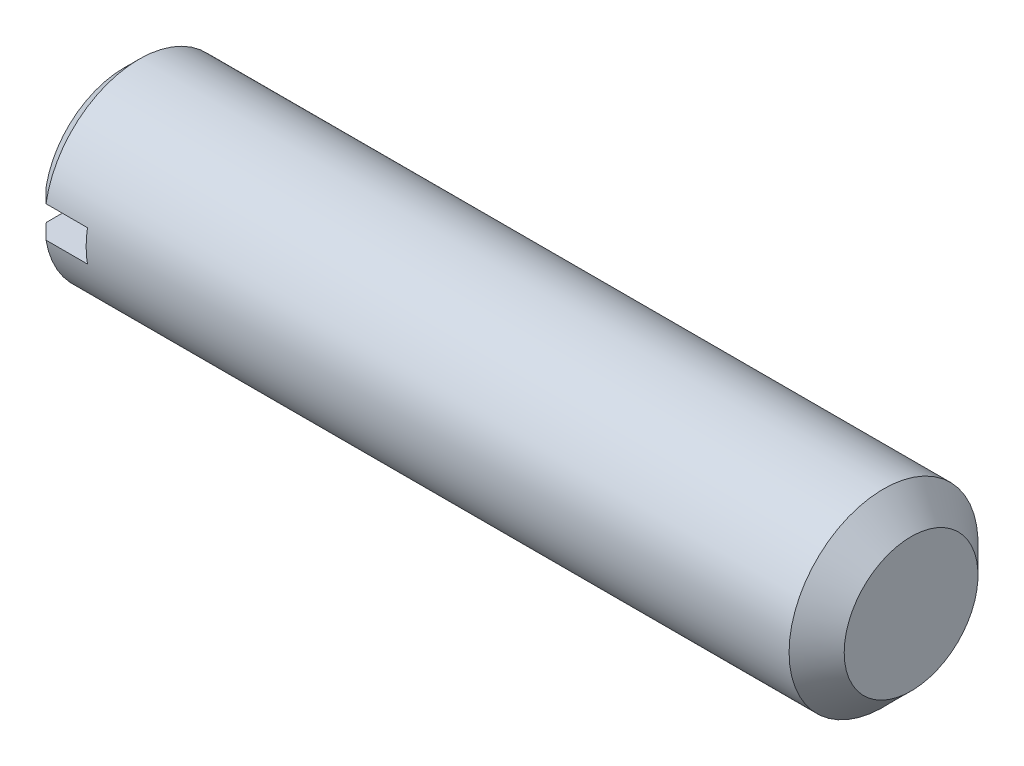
from build123d import *

# Parameters (mm, degrees)
SLOTSKE_W  = 12
SLOTSKE_H  = 2
SLOT_DEPTH = 3.6


with BuildPart() as part:
    # BodySke → BaseBody (revolve)
    with BuildSketch(Plane.XY, mode=Mode.PRIVATE) as basebody_sk:
        Polygon((0, 0), (0, 5.036), (0.964, 6), (48.25, 6), (50, 4.25), (50, 0), align=None)
    revolve(basebody_sk.sketch.rotate(Axis((0, 0, 0), (1, 0, 0)), 90), axis=Axis((0, 0, 0), (1, 0, 0)))

    # SlotSke → Slot (cut)
    with BuildSketch(Plane(origin=(0, 0, 0), x_dir=(0, 0, -1), z_dir=(1, 0, 0))):
        Rectangle(SLOTSKE_W, SLOTSKE_H)
    extrude(amount=SLOT_DEPTH, mode=Mode.SUBTRACT)


solid = part.part
